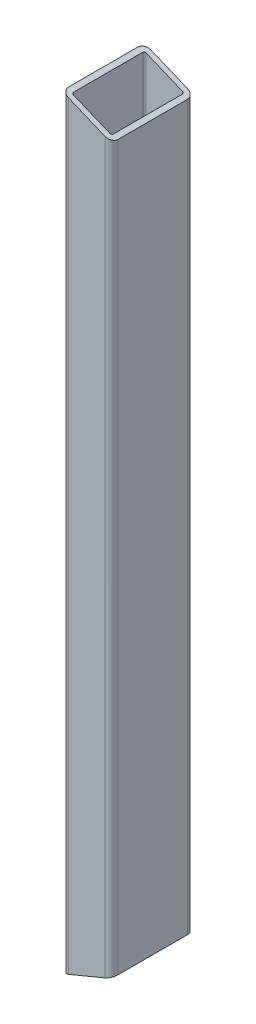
ISO-10303-21;
HEADER;
FILE_DESCRIPTION(('STEP AP214'),'2;1');
FILE_NAME('part.step','',(''),(''),'','','');
FILE_SCHEMA(('AUTOMOTIVE_DESIGN { 1 0 10303 214 1 1 1 1 }'));
ENDSEC;
DATA;
#1=APPLICATION_CONTEXT('core data for automotive mechanical design processes');
#2=APPLICATION_PROTOCOL_DEFINITION('international standard','automotive_design',2000,#1);
#3=PRODUCT_CONTEXT('',#1,'mechanical');
#4=PRODUCT('Part','Part','',(#3));
#5=PRODUCT_RELATED_PRODUCT_CATEGORY('part','',(#4));
#6=PRODUCT_DEFINITION_FORMATION('','',#4);
#7=PRODUCT_DEFINITION_CONTEXT('part definition',#1,'design');
#8=PRODUCT_DEFINITION('design','',#6,#7);
#9=PRODUCT_DEFINITION_SHAPE('','',#8);
#10=(LENGTH_UNIT() NAMED_UNIT(*) SI_UNIT(.MILLI.,.METRE.));
#11=(NAMED_UNIT(*) PLANE_ANGLE_UNIT() SI_UNIT($,.RADIAN.));
#12=(NAMED_UNIT(*) SI_UNIT($,.STERADIAN.) SOLID_ANGLE_UNIT());
#13=UNCERTAINTY_MEASURE_WITH_UNIT(LENGTH_MEASURE(1.E-05),#10,'distance_accuracy_value','');
#14=(GEOMETRIC_REPRESENTATION_CONTEXT(3) GLOBAL_UNCERTAINTY_ASSIGNED_CONTEXT((#13)) GLOBAL_UNIT_ASSIGNED_CONTEXT((#10,
#11,#12)) REPRESENTATION_CONTEXT('',''));
#15=CARTESIAN_POINT('',(0.,0.,0.));
#16=DIRECTION('',(0.,0.,1.));
#17=DIRECTION('',(1.,0.,0.));
#18=AXIS2_PLACEMENT_3D('',#15,#16,#17);
#19=CARTESIAN_POINT('',(0.,0.,22.));
#20=DIRECTION('',(0.,0.,1.));
#21=DIRECTION('',(1.,0.,0.));
#22=AXIS2_PLACEMENT_3D('',#19,#20,#21);
#23=PLANE('',#22);
#24=DIRECTION('',(-0.923879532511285,0.382683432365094,0.));
#25=VECTOR('',#24,1.);
#26=CARTESIAN_POINT('',(15.,218.9235931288,22.));
#27=LINE('',#26,#25);
#28=CARTESIAN_POINT('',(11.,220.580447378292,22.));
#29=VERTEX_POINT('',#28);
#30=CARTESIAN_POINT('',(-11.,229.693145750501,22.));
#31=VERTEX_POINT('',#30);
#32=EDGE_CURVE('E197',#29,#31,#27,.T.);
#33=ORIENTED_EDGE('',*,*,#32,.F.);
#34=DIRECTION('',(0.,1.,0.));
#35=VECTOR('',#34,1.);
#36=CARTESIAN_POINT('',(11.,-220.166233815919,22.));
#37=LINE('',#36,#35);
#38=CARTESIAN_POINT('',(11.,-220.580447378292,22.));
#39=VERTEX_POINT('',#38);
#40=EDGE_CURVE('E222',#29,#39,#37,.F.);
#41=ORIENTED_EDGE('',*,*,#40,.T.);
#42=DIRECTION('',(0.923879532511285,0.382683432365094,0.));
#43=VECTOR('',#42,1.);
#44=CARTESIAN_POINT('',(-15.,-231.349999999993,22.));
#45=LINE('',#44,#43);
#46=CARTESIAN_POINT('',(-11.,-229.693145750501,22.));
#47=VERTEX_POINT('',#46);
#48=EDGE_CURVE('E205',#47,#39,#45,.T.);
#49=ORIENTED_EDGE('',*,*,#48,.F.);
#50=DIRECTION('',(0.,-1.,0.));
#51=VECTOR('',#50,1.);
#52=CARTESIAN_POINT('',(-11.,230.107359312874,22.));
#53=LINE('',#52,#51);
#54=EDGE_CURVE('E220',#47,#31,#53,.F.);
#55=ORIENTED_EDGE('',*,*,#54,.T.);
#56=EDGE_LOOP('',(#33,#41,#49,#55));
#57=FACE_BOUND('',#56,.T.);
#58=ADVANCED_FACE('F35',(#57),#23,.F.);
#59=CARTESIAN_POINT('',(-15.,231.349999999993,22.));
#60=DIRECTION('',(-1.,0.,0.));
#61=DIRECTION('',(0.,0.,1.));
#62=AXIS2_PLACEMENT_3D('',#59,#60,#61);
#63=PLANE('',#62);
#64=DIRECTION('',(0.,0.,1.));
#65=VECTOR('',#64,1.);
#66=CARTESIAN_POINT('',(-15.,-231.349999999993,22.));
#67=LINE('',#66,#65);
#68=CARTESIAN_POINT('',(-15.,-231.349999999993,-21.));
#69=VERTEX_POINT('',#68);
#70=CARTESIAN_POINT('',(-15.,-231.349999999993,21.));
#71=VERTEX_POINT('',#70);
#72=EDGE_CURVE('E193',#69,#71,#67,.T.);
#73=ORIENTED_EDGE('',*,*,#72,.T.);
#74=DIRECTION('',(0.,-1.,0.));
#75=VECTOR('',#74,1.);
#76=CARTESIAN_POINT('',(-15.,231.349999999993,21.));
#77=LINE('',#76,#75);
#78=CARTESIAN_POINT('',(-15.,231.349999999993,21.));
#79=VERTEX_POINT('',#78);
#80=EDGE_CURVE('E267',#71,#79,#77,.F.);
#81=ORIENTED_EDGE('',*,*,#80,.T.);
#82=DIRECTION('',(0.,0.,1.));
#83=VECTOR('',#82,1.);
#84=CARTESIAN_POINT('',(-15.,231.349999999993,22.));
#85=LINE('',#84,#83);
#86=CARTESIAN_POINT('',(-15.,231.349999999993,-21.));
#87=VERTEX_POINT('',#86);
#88=EDGE_CURVE('E175',#87,#79,#85,.T.);
#89=ORIENTED_EDGE('',*,*,#88,.F.);
#90=DIRECTION('',(0.,1.,0.));
#91=VECTOR('',#90,1.);
#92=CARTESIAN_POINT('',(-15.,-231.349999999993,-21.));
#93=LINE('',#92,#91);
#94=EDGE_CURVE('E265',#87,#69,#93,.F.);
#95=ORIENTED_EDGE('',*,*,#94,.T.);
#96=EDGE_LOOP('',(#73,#81,#89,#95));
#97=FACE_BOUND('',#96,.T.);
#98=ADVANCED_FACE('F326',(#97),#63,.T.);
#99=CARTESIAN_POINT('',(15.,218.9235931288,22.));
#100=DIRECTION('',(0.382683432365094,0.923879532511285,0.));
#101=DIRECTION('',(-0.923879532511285,0.382683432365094,0.));
#102=AXIS2_PLACEMENT_3D('',#99,#100,#101);
#103=PLANE('',#102);
#104=DIRECTION('',(-0.923879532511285,0.382683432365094,0.));
#105=VECTOR('',#104,1.);
#106=CARTESIAN_POINT('',(15.,218.9235931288,25.));
#107=LINE('',#106,#105);
#108=CARTESIAN_POINT('',(11.,220.580447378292,25.));
#109=VERTEX_POINT('',#108);
#110=CARTESIAN_POINT('',(-11.,229.693145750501,25.));
#111=VERTEX_POINT('',#110);
#112=EDGE_CURVE('E202',#109,#111,#107,.T.);
#113=ORIENTED_EDGE('',*,*,#112,.F.);
#114=CARTESIAN_POINT('',(11.,220.580447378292,21.));
#115=DIRECTION('',(0.382683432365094,0.923879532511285,0.));
#116=DIRECTION('',(-0.923879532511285,0.382683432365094,0.));
#117=AXIS2_PLACEMENT_3D('',#114,#115,#116);
#118=ELLIPSE('',#117,4.32956880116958,4.);
#119=CARTESIAN_POINT('',(15.,218.9235931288,21.));
#120=VERTEX_POINT('',#119);
#121=EDGE_CURVE('E253',#109,#120,#118,.T.);
#122=ORIENTED_EDGE('',*,*,#121,.T.);
#123=DIRECTION('',(0.,0.,1.));
#124=VECTOR('',#123,1.);
#125=CARTESIAN_POINT('',(15.,218.9235931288,22.));
#126=LINE('',#125,#124);
#127=CARTESIAN_POINT('',(15.,218.9235931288,-21.));
#128=VERTEX_POINT('',#127);
#129=EDGE_CURVE('E180',#128,#120,#126,.T.);
#130=ORIENTED_EDGE('',*,*,#129,.F.);
#131=CARTESIAN_POINT('',(11.,220.580447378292,-21.));
#132=DIRECTION('',(0.382683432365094,0.923879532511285,0.));
#133=DIRECTION('',(-0.923879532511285,0.382683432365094,0.));
#134=AXIS2_PLACEMENT_3D('',#131,#132,#133);
#135=ELLIPSE('',#134,4.32956880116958,4.);
#136=CARTESIAN_POINT('',(11.,220.580447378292,-25.));
#137=VERTEX_POINT('',#136);
#138=EDGE_CURVE('E249',#128,#137,#135,.T.);
#139=ORIENTED_EDGE('',*,*,#138,.T.);
#140=DIRECTION('',(0.923879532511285,-0.382683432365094,0.));
#141=VECTOR('',#140,1.);
#142=CARTESIAN_POINT('',(15.,218.9235931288,-25.));
#143=LINE('',#142,#141);
#144=CARTESIAN_POINT('',(-11.,229.693145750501,-25.));
#145=VERTEX_POINT('',#144);
#146=EDGE_CURVE('E274',#145,#137,#143,.T.);
#147=ORIENTED_EDGE('',*,*,#146,.F.);
#148=CARTESIAN_POINT('',(-11.,229.693145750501,-21.));
#149=DIRECTION('',(0.382683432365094,0.923879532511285,0.));
#150=DIRECTION('',(0.923879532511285,-0.382683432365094,0.));
#151=AXIS2_PLACEMENT_3D('',#148,#149,#150);
#152=ELLIPSE('',#151,4.32956880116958,4.);
#153=EDGE_CURVE('E247',#145,#87,#152,.T.);
#154=ORIENTED_EDGE('',*,*,#153,.T.);
#155=ORIENTED_EDGE('',*,*,#88,.T.);
#156=CARTESIAN_POINT('',(-11.,229.693145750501,21.));
#157=DIRECTION('',(0.382683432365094,0.923879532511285,0.));
#158=DIRECTION('',(0.923879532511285,-0.382683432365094,0.));
#159=AXIS2_PLACEMENT_3D('',#156,#157,#158);
#160=ELLIPSE('',#159,4.32956880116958,4.);
#161=EDGE_CURVE('E251',#79,#111,#160,.T.);
#162=ORIENTED_EDGE('',*,*,#161,.T.);
#163=EDGE_LOOP('',(#113,#122,#130,#139,#147,#154,#155,#162));
#164=FACE_BOUND('',#163,.T.);
#165=DIRECTION('',(0.,0.,1.));
#166=VECTOR('',#165,1.);
#167=CARTESIAN_POINT('',(-12.,230.107359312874,-22.));
#168=LINE('',#167,#166);
#169=CARTESIAN_POINT('',(-12.,230.107359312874,-21.));
#170=VERTEX_POINT('',#169);
#171=CARTESIAN_POINT('',(-12.,230.107359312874,21.));
#172=VERTEX_POINT('',#171);
#173=EDGE_CURVE('E156',#170,#172,#168,.T.);
#174=ORIENTED_EDGE('',*,*,#173,.F.);
#175=CARTESIAN_POINT('',(-11.,229.693145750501,-21.));
#176=DIRECTION('',(0.382683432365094,0.923879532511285,0.));
#177=DIRECTION('',(0.923879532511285,-0.382683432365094,0.));
#178=AXIS2_PLACEMENT_3D('',#175,#176,#177);
#179=ELLIPSE('',#178,1.0823922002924,1.);
#180=CARTESIAN_POINT('',(-11.,229.693145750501,-22.));
#181=VERTEX_POINT('',#180);
#182=EDGE_CURVE('E151',#170,#181,#179,.F.);
#183=ORIENTED_EDGE('',*,*,#182,.T.);
#184=DIRECTION('',(0.923879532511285,-0.382683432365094,0.));
#185=VECTOR('',#184,1.);
#186=CARTESIAN_POINT('',(15.,218.9235931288,-22.));
#187=LINE('',#186,#185);
#188=CARTESIAN_POINT('',(11.,220.580447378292,-22.));
#189=VERTEX_POINT('',#188);
#190=EDGE_CURVE('E154',#181,#189,#187,.T.);
#191=ORIENTED_EDGE('',*,*,#190,.T.);
#192=CARTESIAN_POINT('',(11.,220.580447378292,-21.));
#193=DIRECTION('',(0.382683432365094,0.923879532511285,0.));
#194=DIRECTION('',(-0.923879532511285,0.382683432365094,0.));
#195=AXIS2_PLACEMENT_3D('',#192,#193,#194);
#196=ELLIPSE('',#195,1.0823922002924,1.);
#197=CARTESIAN_POINT('',(12.,220.166233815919,-21.));
#198=VERTEX_POINT('',#197);
#199=EDGE_CURVE('E229',#189,#198,#196,.F.);
#200=ORIENTED_EDGE('',*,*,#199,.T.);
#201=DIRECTION('',(0.,0.,1.));
#202=VECTOR('',#201,1.);
#203=CARTESIAN_POINT('',(12.,220.166233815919,-22.));
#204=LINE('',#203,#202);
#205=CARTESIAN_POINT('',(12.,220.166233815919,21.));
#206=VERTEX_POINT('',#205);
#207=EDGE_CURVE('E186',#198,#206,#204,.T.);
#208=ORIENTED_EDGE('',*,*,#207,.T.);
#209=CARTESIAN_POINT('',(11.,220.580447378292,21.));
#210=DIRECTION('',(0.382683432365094,0.923879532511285,0.));
#211=DIRECTION('',(0.923879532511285,-0.382683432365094,0.));
#212=AXIS2_PLACEMENT_3D('',#209,#210,#211);
#213=ELLIPSE('',#212,1.0823922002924,1.);
#214=EDGE_CURVE('E233',#206,#29,#213,.F.);
#215=ORIENTED_EDGE('',*,*,#214,.T.);
#216=ORIENTED_EDGE('',*,*,#32,.T.);
#217=CARTESIAN_POINT('',(-11.,229.693145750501,21.));
#218=DIRECTION('',(0.382683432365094,0.923879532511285,0.));
#219=DIRECTION('',(-0.923879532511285,0.382683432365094,0.));
#220=AXIS2_PLACEMENT_3D('',#217,#218,#219);
#221=ELLIPSE('',#220,1.0823922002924,1.);
#222=EDGE_CURVE('E239',#31,#172,#221,.F.);
#223=ORIENTED_EDGE('',*,*,#222,.T.);
#224=EDGE_LOOP('',(#174,#183,#191,#200,#208,#215,#216,#223));
#225=FACE_BOUND('',#224,.T.);
#226=ADVANCED_FACE('F153',(#164,#225),#103,.T.);
#227=CARTESIAN_POINT('',(15.,-218.9235931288,22.));
#228=DIRECTION('',(1.,0.,0.));
#229=DIRECTION('',(0.,1.,0.));
#230=AXIS2_PLACEMENT_3D('',#227,#228,#229);
#231=PLANE('',#230);
#232=ORIENTED_EDGE('',*,*,#129,.T.);
#233=DIRECTION('',(0.,1.,0.));
#234=VECTOR('',#233,1.);
#235=CARTESIAN_POINT('',(15.,-218.9235931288,21.));
#236=LINE('',#235,#234);
#237=CARTESIAN_POINT('',(15.,-218.9235931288,21.));
#238=VERTEX_POINT('',#237);
#239=EDGE_CURVE('E257',#120,#238,#236,.F.);
#240=ORIENTED_EDGE('',*,*,#239,.T.);
#241=DIRECTION('',(0.,0.,1.));
#242=VECTOR('',#241,1.);
#243=CARTESIAN_POINT('',(15.,-218.9235931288,22.));
#244=LINE('',#243,#242);
#245=CARTESIAN_POINT('',(15.,-218.9235931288,-21.));
#246=VERTEX_POINT('',#245);
#247=EDGE_CURVE('E196',#246,#238,#244,.T.);
#248=ORIENTED_EDGE('',*,*,#247,.F.);
#249=DIRECTION('',(0.,-1.,0.));
#250=VECTOR('',#249,1.);
#251=CARTESIAN_POINT('',(15.,218.9235931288,-21.));
#252=LINE('',#251,#250);
#253=EDGE_CURVE('E255',#246,#128,#252,.F.);
#254=ORIENTED_EDGE('',*,*,#253,.T.);
#255=EDGE_LOOP('',(#232,#240,#248,#254));
#256=FACE_BOUND('',#255,.T.);
#257=ADVANCED_FACE('F341',(#256),#231,.T.);
#258=CARTESIAN_POINT('',(-15.,-231.349999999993,22.));
#259=DIRECTION('',(0.382683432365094,-0.923879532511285,0.));
#260=DIRECTION('',(0.923879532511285,0.382683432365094,0.));
#261=AXIS2_PLACEMENT_3D('',#258,#259,#260);
#262=PLANE('',#261);
#263=DIRECTION('',(0.,0.,1.));
#264=VECTOR('',#263,1.);
#265=CARTESIAN_POINT('',(12.,-220.166233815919,-22.));
#266=LINE('',#265,#264);
#267=CARTESIAN_POINT('',(12.,-220.166233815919,-21.));
#268=VERTEX_POINT('',#267);
#269=CARTESIAN_POINT('',(12.,-220.166233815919,21.));
#270=VERTEX_POINT('',#269);
#271=EDGE_CURVE('E189',#268,#270,#266,.T.);
#272=ORIENTED_EDGE('',*,*,#271,.F.);
#273=CARTESIAN_POINT('',(11.,-220.580447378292,-21.));
#274=DIRECTION('',(0.382683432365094,-0.923879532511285,0.));
#275=DIRECTION('',(0.923879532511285,0.382683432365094,0.));
#276=AXIS2_PLACEMENT_3D('',#273,#274,#275);
#277=ELLIPSE('',#276,1.0823922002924,1.);
#278=CARTESIAN_POINT('',(11.,-220.580447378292,-22.));
#279=VERTEX_POINT('',#278);
#280=EDGE_CURVE('E231',#268,#279,#277,.F.);
#281=ORIENTED_EDGE('',*,*,#280,.T.);
#282=DIRECTION('',(-0.923879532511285,-0.382683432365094,0.));
#283=VECTOR('',#282,1.);
#284=CARTESIAN_POINT('',(-15.,-231.349999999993,-22.));
#285=LINE('',#284,#283);
#286=CARTESIAN_POINT('',(-11.,-229.693145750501,-22.));
#287=VERTEX_POINT('',#286);
#288=EDGE_CURVE('E172',#279,#287,#285,.T.);
#289=ORIENTED_EDGE('',*,*,#288,.T.);
#290=CARTESIAN_POINT('',(-11.,-229.693145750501,-21.));
#291=DIRECTION('',(0.382683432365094,-0.923879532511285,0.));
#292=DIRECTION('',(-0.923879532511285,-0.382683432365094,0.));
#293=AXIS2_PLACEMENT_3D('',#290,#291,#292);
#294=ELLIPSE('',#293,1.0823922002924,1.);
#295=CARTESIAN_POINT('',(-12.,-230.107359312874,-21.));
#296=VERTEX_POINT('',#295);
#297=EDGE_CURVE('E161',#287,#296,#294,.F.);
#298=ORIENTED_EDGE('',*,*,#297,.T.);
#299=DIRECTION('',(0.,0.,1.));
#300=VECTOR('',#299,1.);
#301=CARTESIAN_POINT('',(-12.,-230.107359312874,-22.));
#302=LINE('',#301,#300);
#303=CARTESIAN_POINT('',(-12.,-230.107359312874,21.));
#304=VERTEX_POINT('',#303);
#305=EDGE_CURVE('E283',#296,#304,#302,.T.);
#306=ORIENTED_EDGE('',*,*,#305,.T.);
#307=CARTESIAN_POINT('',(-11.,-229.693145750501,21.));
#308=DIRECTION('',(0.382683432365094,-0.923879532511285,0.));
#309=DIRECTION('',(0.923879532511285,0.382683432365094,0.));
#310=AXIS2_PLACEMENT_3D('',#307,#308,#309);
#311=ELLIPSE('',#310,1.0823922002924,1.);
#312=EDGE_CURVE('E160',#304,#47,#311,.F.);
#313=ORIENTED_EDGE('',*,*,#312,.T.);
#314=ORIENTED_EDGE('',*,*,#48,.T.);
#315=CARTESIAN_POINT('',(11.,-220.580447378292,21.));
#316=DIRECTION('',(0.382683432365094,-0.923879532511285,0.));
#317=DIRECTION('',(-0.923879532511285,-0.382683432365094,0.));
#318=AXIS2_PLACEMENT_3D('',#315,#316,#317);
#319=ELLIPSE('',#318,1.0823922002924,1.);
#320=EDGE_CURVE('E235',#39,#270,#319,.F.);
#321=ORIENTED_EDGE('',*,*,#320,.T.);
#322=EDGE_LOOP('',(#272,#281,#289,#298,#306,#313,#314,#321));
#323=FACE_BOUND('',#322,.T.);
#324=ORIENTED_EDGE('',*,*,#247,.T.);
#325=CARTESIAN_POINT('',(11.,-220.580447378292,21.));
#326=DIRECTION('',(0.382683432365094,-0.923879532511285,0.));
#327=DIRECTION('',(0.923879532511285,0.382683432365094,0.));
#328=AXIS2_PLACEMENT_3D('',#325,#326,#327);
#329=ELLIPSE('',#328,4.32956880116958,4.);
#330=CARTESIAN_POINT('',(11.,-220.580447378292,25.));
#331=VERTEX_POINT('',#330);
#332=EDGE_CURVE('E263',#238,#331,#329,.T.);
#333=ORIENTED_EDGE('',*,*,#332,.T.);
#334=DIRECTION('',(0.923879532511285,0.382683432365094,0.));
#335=VECTOR('',#334,1.);
#336=CARTESIAN_POINT('',(-15.,-231.349999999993,25.));
#337=LINE('',#336,#335);
#338=CARTESIAN_POINT('',(-11.,-229.693145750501,25.));
#339=VERTEX_POINT('',#338);
#340=EDGE_CURVE('E206',#339,#331,#337,.T.);
#341=ORIENTED_EDGE('',*,*,#340,.F.);
#342=CARTESIAN_POINT('',(-11.,-229.693145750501,21.));
#343=DIRECTION('',(0.382683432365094,-0.923879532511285,0.));
#344=DIRECTION('',(-0.923879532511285,-0.382683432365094,0.));
#345=AXIS2_PLACEMENT_3D('',#342,#343,#344);
#346=ELLIPSE('',#345,4.32956880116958,4.);
#347=EDGE_CURVE('E261',#339,#71,#346,.T.);
#348=ORIENTED_EDGE('',*,*,#347,.T.);
#349=ORIENTED_EDGE('',*,*,#72,.F.);
#350=CARTESIAN_POINT('',(-11.,-229.693145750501,-21.));
#351=DIRECTION('',(0.382683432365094,-0.923879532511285,0.));
#352=DIRECTION('',(-0.923879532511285,-0.382683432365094,0.));
#353=AXIS2_PLACEMENT_3D('',#350,#351,#352);
#354=ELLIPSE('',#353,4.32956880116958,4.);
#355=CARTESIAN_POINT('',(-11.,-229.693145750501,-25.));
#356=VERTEX_POINT('',#355);
#357=EDGE_CURVE('E50',#69,#356,#354,.T.);
#358=ORIENTED_EDGE('',*,*,#357,.T.);
#359=DIRECTION('',(-0.923879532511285,-0.382683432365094,0.));
#360=VECTOR('',#359,1.);
#361=CARTESIAN_POINT('',(-15.,-231.349999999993,-25.));
#362=LINE('',#361,#360);
#363=CARTESIAN_POINT('',(11.,-220.580447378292,-25.));
#364=VERTEX_POINT('',#363);
#365=EDGE_CURVE('E275',#364,#356,#362,.T.);
#366=ORIENTED_EDGE('',*,*,#365,.F.);
#367=CARTESIAN_POINT('',(11.,-220.580447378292,-21.));
#368=DIRECTION('',(0.382683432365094,-0.923879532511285,0.));
#369=DIRECTION('',(0.923879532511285,0.382683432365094,0.));
#370=AXIS2_PLACEMENT_3D('',#367,#368,#369);
#371=ELLIPSE('',#370,4.32956880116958,4.);
#372=EDGE_CURVE('E58',#364,#246,#371,.T.);
#373=ORIENTED_EDGE('',*,*,#372,.T.);
#374=EDGE_LOOP('',(#324,#333,#341,#348,#349,#358,#366,#373));
#375=FACE_BOUND('',#374,.T.);
#376=ADVANCED_FACE('F299',(#323,#375),#262,.T.);
#377=CARTESIAN_POINT('',(0.,0.,25.));
#378=DIRECTION('',(0.,0.,1.));
#379=DIRECTION('',(1.,0.,0.));
#380=AXIS2_PLACEMENT_3D('',#377,#378,#379);
#381=PLANE('',#380);
#382=ORIENTED_EDGE('',*,*,#340,.T.);
#383=DIRECTION('',(0.,1.,0.));
#384=VECTOR('',#383,1.);
#385=CARTESIAN_POINT('',(11.,0.,25.));
#386=LINE('',#385,#384);
#387=EDGE_CURVE('E244',#331,#109,#386,.T.);
#388=ORIENTED_EDGE('',*,*,#387,.T.);
#389=ORIENTED_EDGE('',*,*,#112,.T.);
#390=DIRECTION('',(0.,-1.,0.));
#391=VECTOR('',#390,1.);
#392=CARTESIAN_POINT('',(-11.,0.,25.));
#393=LINE('',#392,#391);
#394=EDGE_CURVE('E241',#111,#339,#393,.T.);
#395=ORIENTED_EDGE('',*,*,#394,.T.);
#396=EDGE_LOOP('',(#382,#388,#389,#395));
#397=FACE_BOUND('',#396,.T.);
#398=ADVANCED_FACE('F335',(#397),#381,.T.);
#399=CARTESIAN_POINT('',(12.,220.166233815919,-22.));
#400=DIRECTION('',(1.,0.,0.));
#401=DIRECTION('',(0.,1.,0.));
#402=AXIS2_PLACEMENT_3D('',#399,#400,#401);
#403=PLANE('',#402);
#404=ORIENTED_EDGE('',*,*,#207,.F.);
#405=DIRECTION('',(0.,1.,0.));
#406=VECTOR('',#405,1.);
#407=CARTESIAN_POINT('',(12.,220.166233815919,-21.));
#408=LINE('',#407,#406);
#409=EDGE_CURVE('E217',#198,#268,#408,.F.);
#410=ORIENTED_EDGE('',*,*,#409,.T.);
#411=ORIENTED_EDGE('',*,*,#271,.T.);
#412=DIRECTION('',(0.,1.,0.));
#413=VECTOR('',#412,1.);
#414=CARTESIAN_POINT('',(12.,220.166233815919,21.));
#415=LINE('',#414,#413);
#416=EDGE_CURVE('E177',#270,#206,#415,.T.);
#417=ORIENTED_EDGE('',*,*,#416,.T.);
#418=EDGE_LOOP('',(#404,#410,#411,#417));
#419=FACE_BOUND('',#418,.T.);
#420=ADVANCED_FACE('F312',(#419),#403,.F.);
#421=CARTESIAN_POINT('',(-12.,-230.107359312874,-22.));
#422=DIRECTION('',(-1.,0.,0.));
#423=DIRECTION('',(0.,-1.,0.));
#424=AXIS2_PLACEMENT_3D('',#421,#422,#423);
#425=PLANE('',#424);
#426=ORIENTED_EDGE('',*,*,#305,.F.);
#427=DIRECTION('',(0.,-1.,0.));
#428=VECTOR('',#427,1.);
#429=CARTESIAN_POINT('',(-12.,-230.107359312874,-21.));
#430=LINE('',#429,#428);
#431=EDGE_CURVE('E227',#296,#170,#430,.F.);
#432=ORIENTED_EDGE('',*,*,#431,.T.);
#433=ORIENTED_EDGE('',*,*,#173,.T.);
#434=DIRECTION('',(0.,-1.,0.));
#435=VECTOR('',#434,1.);
#436=CARTESIAN_POINT('',(-12.,-230.107359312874,21.));
#437=LINE('',#436,#435);
#438=EDGE_CURVE('E224',#172,#304,#437,.T.);
#439=ORIENTED_EDGE('',*,*,#438,.T.);
#440=EDGE_LOOP('',(#426,#432,#433,#439));
#441=FACE_BOUND('',#440,.T.);
#442=ADVANCED_FACE('F291',(#441),#425,.F.);
#443=CARTESIAN_POINT('',(0.,0.,-22.));
#444=DIRECTION('',(0.,0.,1.));
#445=DIRECTION('',(1.,0.,0.));
#446=AXIS2_PLACEMENT_3D('',#443,#444,#445);
#447=PLANE('',#446);
#448=ORIENTED_EDGE('',*,*,#288,.F.);
#449=DIRECTION('',(0.,1.,0.));
#450=VECTOR('',#449,1.);
#451=CARTESIAN_POINT('',(11.,0.,-22.));
#452=LINE('',#451,#450);
#453=EDGE_CURVE('E171',#279,#189,#452,.T.);
#454=ORIENTED_EDGE('',*,*,#453,.T.);
#455=ORIENTED_EDGE('',*,*,#190,.F.);
#456=DIRECTION('',(0.,-1.,0.));
#457=VECTOR('',#456,1.);
#458=CARTESIAN_POINT('',(-11.,0.,-22.));
#459=LINE('',#458,#457);
#460=EDGE_CURVE('E168',#181,#287,#459,.T.);
#461=ORIENTED_EDGE('',*,*,#460,.T.);
#462=EDGE_LOOP('',(#448,#454,#455,#461));
#463=FACE_BOUND('',#462,.T.);
#464=ADVANCED_FACE('F167',(#463),#447,.T.);
#465=CARTESIAN_POINT('',(0.,0.,-25.));
#466=DIRECTION('',(0.,0.,1.));
#467=DIRECTION('',(1.,0.,0.));
#468=AXIS2_PLACEMENT_3D('',#465,#466,#467);
#469=PLANE('',#468);
#470=ORIENTED_EDGE('',*,*,#146,.T.);
#471=DIRECTION('',(0.,-1.,0.));
#472=VECTOR('',#471,1.);
#473=CARTESIAN_POINT('',(11.,-218.9235931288,-25.));
#474=LINE('',#473,#472);
#475=EDGE_CURVE('E11',#137,#364,#474,.T.);
#476=ORIENTED_EDGE('',*,*,#475,.T.);
#477=ORIENTED_EDGE('',*,*,#365,.T.);
#478=DIRECTION('',(0.,1.,0.));
#479=VECTOR('',#478,1.);
#480=CARTESIAN_POINT('',(-11.,231.349999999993,-25.));
#481=LINE('',#480,#479);
#482=EDGE_CURVE('E43',#356,#145,#481,.T.);
#483=ORIENTED_EDGE('',*,*,#482,.T.);
#484=EDGE_LOOP('',(#470,#476,#477,#483));
#485=FACE_BOUND('',#484,.T.);
#486=ADVANCED_FACE('F273',(#485),#469,.F.);
#487=CARTESIAN_POINT('',(11.,0.,-21.));
#488=DIRECTION('',(0.,1.,0.));
#489=DIRECTION('',(-1.,0.,0.));
#490=AXIS2_PLACEMENT_3D('',#487,#488,#489);
#491=CYLINDRICAL_SURFACE('',#490,1.);
#492=ORIENTED_EDGE('',*,*,#280,.F.);
#493=ORIENTED_EDGE('',*,*,#409,.F.);
#494=ORIENTED_EDGE('',*,*,#199,.F.);
#495=ORIENTED_EDGE('',*,*,#453,.F.);
#496=EDGE_LOOP('',(#492,#493,#494,#495));
#497=FACE_BOUND('',#496,.T.);
#498=ADVANCED_FACE('F315',(#497),#491,.F.);
#499=CARTESIAN_POINT('',(11.,220.166233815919,21.));
#500=DIRECTION('',(0.,-1.,0.));
#501=DIRECTION('',(1.,0.,0.));
#502=AXIS2_PLACEMENT_3D('',#499,#500,#501);
#503=CYLINDRICAL_SURFACE('',#502,1.);
#504=ORIENTED_EDGE('',*,*,#320,.F.);
#505=ORIENTED_EDGE('',*,*,#40,.F.);
#506=ORIENTED_EDGE('',*,*,#214,.F.);
#507=ORIENTED_EDGE('',*,*,#416,.F.);
#508=EDGE_LOOP('',(#504,#505,#506,#507));
#509=FACE_BOUND('',#508,.T.);
#510=ADVANCED_FACE('F305',(#509),#503,.F.);
#511=CARTESIAN_POINT('',(-11.,0.,-21.));
#512=DIRECTION('',(0.,-1.,0.));
#513=DIRECTION('',(1.,0.,0.));
#514=AXIS2_PLACEMENT_3D('',#511,#512,#513);
#515=CYLINDRICAL_SURFACE('',#514,1.);
#516=ORIENTED_EDGE('',*,*,#182,.F.);
#517=ORIENTED_EDGE('',*,*,#431,.F.);
#518=ORIENTED_EDGE('',*,*,#297,.F.);
#519=ORIENTED_EDGE('',*,*,#460,.F.);
#520=EDGE_LOOP('',(#516,#517,#518,#519));
#521=FACE_BOUND('',#520,.T.);
#522=ADVANCED_FACE('F174',(#521),#515,.F.);
#523=CARTESIAN_POINT('',(-11.,-230.107359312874,21.));
#524=DIRECTION('',(0.,1.,0.));
#525=DIRECTION('',(-1.,0.,0.));
#526=AXIS2_PLACEMENT_3D('',#523,#524,#525);
#527=CYLINDRICAL_SURFACE('',#526,1.);
#528=ORIENTED_EDGE('',*,*,#222,.F.);
#529=ORIENTED_EDGE('',*,*,#54,.F.);
#530=ORIENTED_EDGE('',*,*,#312,.F.);
#531=ORIENTED_EDGE('',*,*,#438,.F.);
#532=EDGE_LOOP('',(#528,#529,#530,#531));
#533=FACE_BOUND('',#532,.T.);
#534=ADVANCED_FACE('F294',(#533),#527,.F.);
#535=CARTESIAN_POINT('',(11.,0.,21.));
#536=DIRECTION('',(0.,1.,0.));
#537=DIRECTION('',(-1.,0.,0.));
#538=AXIS2_PLACEMENT_3D('',#535,#536,#537);
#539=CYLINDRICAL_SURFACE('',#538,4.);
#540=ORIENTED_EDGE('',*,*,#332,.F.);
#541=ORIENTED_EDGE('',*,*,#239,.F.);
#542=ORIENTED_EDGE('',*,*,#121,.F.);
#543=ORIENTED_EDGE('',*,*,#387,.F.);
#544=EDGE_LOOP('',(#540,#541,#542,#543));
#545=FACE_BOUND('',#544,.T.);
#546=ADVANCED_FACE('F380',(#545),#539,.T.);
#547=CARTESIAN_POINT('',(-11.,0.,21.));
#548=DIRECTION('',(0.,-1.,0.));
#549=DIRECTION('',(0.,0.,-1.));
#550=AXIS2_PLACEMENT_3D('',#547,#548,#549);
#551=CYLINDRICAL_SURFACE('',#550,4.);
#552=ORIENTED_EDGE('',*,*,#161,.F.);
#553=ORIENTED_EDGE('',*,*,#80,.F.);
#554=ORIENTED_EDGE('',*,*,#347,.F.);
#555=ORIENTED_EDGE('',*,*,#394,.F.);
#556=EDGE_LOOP('',(#552,#553,#554,#555));
#557=FACE_BOUND('',#556,.T.);
#558=ADVANCED_FACE('F385',(#557),#551,.T.);
#559=CARTESIAN_POINT('',(11.,0.,-21.));
#560=DIRECTION('',(0.,1.,0.));
#561=DIRECTION('',(-1.,0.,0.));
#562=AXIS2_PLACEMENT_3D('',#559,#560,#561);
#563=CYLINDRICAL_SURFACE('',#562,4.);
#564=ORIENTED_EDGE('',*,*,#138,.F.);
#565=ORIENTED_EDGE('',*,*,#253,.F.);
#566=ORIENTED_EDGE('',*,*,#372,.F.);
#567=ORIENTED_EDGE('',*,*,#475,.F.);
#568=EDGE_LOOP('',(#564,#565,#566,#567));
#569=FACE_BOUND('',#568,.T.);
#570=ADVANCED_FACE('F397',(#569),#563,.T.);
#571=CARTESIAN_POINT('',(-11.,0.,-21.));
#572=DIRECTION('',(0.,-1.,0.));
#573=DIRECTION('',(0.,0.,-1.));
#574=AXIS2_PLACEMENT_3D('',#571,#572,#573);
#575=CYLINDRICAL_SURFACE('',#574,4.);
#576=ORIENTED_EDGE('',*,*,#357,.F.);
#577=ORIENTED_EDGE('',*,*,#94,.F.);
#578=ORIENTED_EDGE('',*,*,#153,.F.);
#579=ORIENTED_EDGE('',*,*,#482,.F.);
#580=EDGE_LOOP('',(#576,#577,#578,#579));
#581=FACE_BOUND('',#580,.T.);
#582=ADVANCED_FACE('F37',(#581),#575,.T.);
#583=CLOSED_SHELL('',(#58,#98,#226,#257,#376,#398,#420,#442,#464,#486,#498,#510,#522,#534,#546,
#558,#570,#582));
#584=MANIFOLD_SOLID_BREP('B2',#583);
#585=ADVANCED_BREP_SHAPE_REPRESENTATION('',(#18,#584),#14);
#586=SHAPE_DEFINITION_REPRESENTATION(#9,#585);
ENDSEC;
END-ISO-10303-21;
